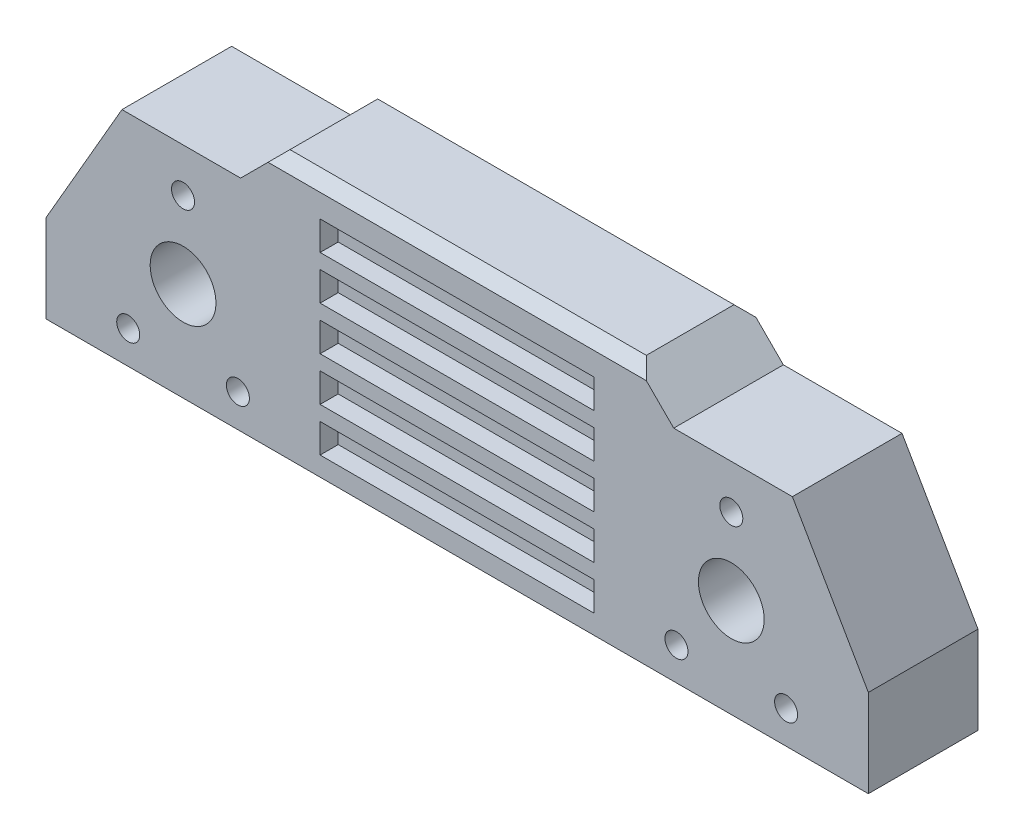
ISO-10303-21;
HEADER;
FILE_DESCRIPTION(('STEP AP214'),'2;1');
FILE_NAME('part.step','',(''),(''),'','','');
FILE_SCHEMA(('AUTOMOTIVE_DESIGN { 1 0 10303 214 1 1 1 1 }'));
ENDSEC;
DATA;
#1=APPLICATION_CONTEXT('core data for automotive mechanical design processes');
#2=APPLICATION_PROTOCOL_DEFINITION('international standard','automotive_design',2000,#1);
#3=PRODUCT_CONTEXT('',#1,'mechanical');
#4=PRODUCT('Part','Part','',(#3));
#5=PRODUCT_RELATED_PRODUCT_CATEGORY('part','',(#4));
#6=PRODUCT_DEFINITION_FORMATION('','',#4);
#7=PRODUCT_DEFINITION_CONTEXT('part definition',#1,'design');
#8=PRODUCT_DEFINITION('design','',#6,#7);
#9=PRODUCT_DEFINITION_SHAPE('','',#8);
#10=(LENGTH_UNIT() NAMED_UNIT(*) SI_UNIT(.MILLI.,.METRE.));
#11=(NAMED_UNIT(*) PLANE_ANGLE_UNIT() SI_UNIT($,.RADIAN.));
#12=(NAMED_UNIT(*) SI_UNIT($,.STERADIAN.) SOLID_ANGLE_UNIT());
#13=UNCERTAINTY_MEASURE_WITH_UNIT(LENGTH_MEASURE(1.E-05),#10,'distance_accuracy_value','');
#14=(GEOMETRIC_REPRESENTATION_CONTEXT(3) GLOBAL_UNCERTAINTY_ASSIGNED_CONTEXT((#13)) GLOBAL_UNIT_ASSIGNED_CONTEXT((#10,
#11,#12)) REPRESENTATION_CONTEXT('',''));
#15=CARTESIAN_POINT('',(0.,0.,0.));
#16=DIRECTION('',(0.,0.,1.));
#17=DIRECTION('',(1.,0.,0.));
#18=AXIS2_PLACEMENT_3D('',#15,#16,#17);
#19=CARTESIAN_POINT('',(0.,0.,10.));
#20=DIRECTION('',(0.,0.,1.));
#21=DIRECTION('',(1.,0.,0.));
#22=AXIS2_PLACEMENT_3D('',#19,#20,#21);
#23=PLANE('',#22);
#24=CARTESIAN_POINT('',(-49.9999999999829,32.,10.));
#25=DIRECTION('',(0.,0.,1.));
#26=DIRECTION('',(1.,0.,0.));
#27=AXIS2_PLACEMENT_3D('',#24,#25,#26);
#28=CIRCLE('',#27,2.09999999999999);
#29=CARTESIAN_POINT('',(-47.899999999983,32.,10.));
#30=VERTEX_POINT('',#29);
#31=EDGE_CURVE('E279',#30,#30,#28,.T.);
#32=ORIENTED_EDGE('',*,*,#31,.F.);
#33=EDGE_LOOP('',(#32));
#34=FACE_BOUND('',#33,.T.);
#35=CARTESIAN_POINT('',(-39.999999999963,6.,10.));
#36=DIRECTION('',(0.,0.,1.));
#37=DIRECTION('',(1.,0.,0.));
#38=AXIS2_PLACEMENT_3D('',#35,#36,#37);
#39=CIRCLE('',#38,2.09999999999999);
#40=CARTESIAN_POINT('',(-37.8999999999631,6.,10.));
#41=VERTEX_POINT('',#40);
#42=EDGE_CURVE('E278',#41,#41,#39,.T.);
#43=ORIENTED_EDGE('',*,*,#42,.F.);
#44=EDGE_LOOP('',(#43));
#45=FACE_BOUND('',#44,.T.);
#46=CARTESIAN_POINT('',(-60.0000000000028,6.,10.));
#47=DIRECTION('',(0.,0.,1.));
#48=DIRECTION('',(1.,0.,0.));
#49=AXIS2_PLACEMENT_3D('',#46,#47,#48);
#50=CIRCLE('',#49,2.09999999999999);
#51=CARTESIAN_POINT('',(-57.9000000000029,6.,10.));
#52=VERTEX_POINT('',#51);
#53=EDGE_CURVE('E289',#52,#52,#50,.T.);
#54=ORIENTED_EDGE('',*,*,#53,.F.);
#55=EDGE_LOOP('',(#54));
#56=FACE_BOUND('',#55,.T.);
#57=CARTESIAN_POINT('',(49.9999999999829,32.,10.));
#58=DIRECTION('',(0.,0.,1.));
#59=DIRECTION('',(1.,0.,0.));
#60=AXIS2_PLACEMENT_3D('',#57,#58,#59);
#61=CIRCLE('',#60,2.09999999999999);
#62=CARTESIAN_POINT('',(52.0999999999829,32.,10.));
#63=VERTEX_POINT('',#62);
#64=EDGE_CURVE('E454',#63,#63,#61,.T.);
#65=ORIENTED_EDGE('',*,*,#64,.F.);
#66=EDGE_LOOP('',(#65));
#67=FACE_BOUND('',#66,.T.);
#68=CARTESIAN_POINT('',(39.999999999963,6.,10.));
#69=DIRECTION('',(0.,0.,1.));
#70=DIRECTION('',(1.,0.,0.));
#71=AXIS2_PLACEMENT_3D('',#68,#69,#70);
#72=CIRCLE('',#71,2.09999999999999);
#73=CARTESIAN_POINT('',(42.099999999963,6.,10.));
#74=VERTEX_POINT('',#73);
#75=EDGE_CURVE('E466',#74,#74,#72,.T.);
#76=ORIENTED_EDGE('',*,*,#75,.F.);
#77=EDGE_LOOP('',(#76));
#78=FACE_BOUND('',#77,.T.);
#79=CARTESIAN_POINT('',(60.0000000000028,6.,10.));
#80=DIRECTION('',(0.,0.,1.));
#81=DIRECTION('',(1.,0.,0.));
#82=AXIS2_PLACEMENT_3D('',#79,#80,#81);
#83=CIRCLE('',#82,2.09999999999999);
#84=CARTESIAN_POINT('',(62.1000000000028,6.,10.));
#85=VERTEX_POINT('',#84);
#86=EDGE_CURVE('E472',#85,#85,#83,.T.);
#87=ORIENTED_EDGE('',*,*,#86,.F.);
#88=EDGE_LOOP('',(#87));
#89=FACE_BOUND('',#88,.T.);
#90=CARTESIAN_POINT('',(-49.9999999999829,18.,10.));
#91=DIRECTION('',(0.,0.,1.));
#92=DIRECTION('',(-1.,0.,0.));
#93=AXIS2_PLACEMENT_3D('',#90,#91,#92);
#94=CIRCLE('',#93,6.);
#95=CARTESIAN_POINT('',(-55.999999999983,18.,10.));
#96=VERTEX_POINT('',#95);
#97=EDGE_CURVE('E485',#96,#96,#94,.T.);
#98=ORIENTED_EDGE('',*,*,#97,.F.);
#99=EDGE_LOOP('',(#98));
#100=FACE_BOUND('',#99,.T.);
#101=DIRECTION('',(-0.707106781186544,0.707106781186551,0.));
#102=VECTOR('',#101,1.);
#103=CARTESIAN_POINT('',(39.4999999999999,40.,10.));
#104=LINE('',#103,#102);
#105=CARTESIAN_POINT('',(39.4999999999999,40.,10.));
#106=VERTEX_POINT('',#105);
#107=CARTESIAN_POINT('',(34.5,45.,10.));
#108=VERTEX_POINT('',#107);
#109=EDGE_CURVE('E499',#106,#108,#104,.T.);
#110=ORIENTED_EDGE('',*,*,#109,.T.);
#111=DIRECTION('',(-1.,0.,0.));
#112=VECTOR('',#111,1.);
#113=CARTESIAN_POINT('',(-32.5,45.,10.));
#114=LINE('',#113,#112);
#115=CARTESIAN_POINT('',(-34.5,45.,10.));
#116=VERTEX_POINT('',#115);
#117=EDGE_CURVE('E11',#108,#116,#114,.T.);
#118=ORIENTED_EDGE('',*,*,#117,.T.);
#119=DIRECTION('',(-0.707106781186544,-0.707106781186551,0.));
#120=VECTOR('',#119,1.);
#121=CARTESIAN_POINT('',(-39.4999999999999,40.,10.));
#122=LINE('',#121,#120);
#123=CARTESIAN_POINT('',(-39.4999999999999,40.,10.));
#124=VERTEX_POINT('',#123);
#125=EDGE_CURVE('E501',#116,#124,#122,.T.);
#126=ORIENTED_EDGE('',*,*,#125,.T.);
#127=DIRECTION('',(-1.,0.,0.));
#128=VECTOR('',#127,1.);
#129=CARTESIAN_POINT('',(-61.1435935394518,40.,10.));
#130=LINE('',#129,#128);
#131=CARTESIAN_POINT('',(-61.1435935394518,40.,10.));
#132=VERTEX_POINT('',#131);
#133=EDGE_CURVE('E503',#124,#132,#130,.T.);
#134=ORIENTED_EDGE('',*,*,#133,.T.);
#135=DIRECTION('',(-0.500000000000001,-0.866025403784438,0.));
#136=VECTOR('',#135,1.);
#137=CARTESIAN_POINT('',(-75.0000000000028,16.,10.));
#138=LINE('',#137,#136);
#139=CARTESIAN_POINT('',(-75.0000000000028,16.,10.));
#140=VERTEX_POINT('',#139);
#141=EDGE_CURVE('E505',#132,#140,#138,.T.);
#142=ORIENTED_EDGE('',*,*,#141,.T.);
#143=DIRECTION('',(0.,-1.,0.));
#144=VECTOR('',#143,1.);
#145=CARTESIAN_POINT('',(-75.0000000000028,0.,10.));
#146=LINE('',#145,#144);
#147=CARTESIAN_POINT('',(-75.0000000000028,0.,10.));
#148=VERTEX_POINT('',#147);
#149=EDGE_CURVE('E507',#140,#148,#146,.T.);
#150=ORIENTED_EDGE('',*,*,#149,.T.);
#151=DIRECTION('',(1.,0.,0.));
#152=VECTOR('',#151,1.);
#153=CARTESIAN_POINT('',(-75.0000000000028,0.,10.));
#154=LINE('',#153,#152);
#155=CARTESIAN_POINT('',(75.0000000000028,0.,10.));
#156=VERTEX_POINT('',#155);
#157=EDGE_CURVE('E509',#148,#156,#154,.T.);
#158=ORIENTED_EDGE('',*,*,#157,.T.);
#159=DIRECTION('',(0.,1.,0.));
#160=VECTOR('',#159,1.);
#161=CARTESIAN_POINT('',(75.0000000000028,0.,10.));
#162=LINE('',#161,#160);
#163=CARTESIAN_POINT('',(75.0000000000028,16.,10.));
#164=VERTEX_POINT('',#163);
#165=EDGE_CURVE('E491',#156,#164,#162,.T.);
#166=ORIENTED_EDGE('',*,*,#165,.T.);
#167=DIRECTION('',(-0.500000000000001,0.866025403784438,0.));
#168=VECTOR('',#167,1.);
#169=CARTESIAN_POINT('',(75.0000000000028,16.,10.));
#170=LINE('',#169,#168);
#171=CARTESIAN_POINT('',(61.1435935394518,40.,10.));
#172=VERTEX_POINT('',#171);
#173=EDGE_CURVE('E494',#164,#172,#170,.T.);
#174=ORIENTED_EDGE('',*,*,#173,.T.);
#175=DIRECTION('',(-1.,0.,0.));
#176=VECTOR('',#175,1.);
#177=CARTESIAN_POINT('',(61.1435935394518,40.,10.));
#178=LINE('',#177,#176);
#179=EDGE_CURVE('E497',#172,#106,#178,.T.);
#180=ORIENTED_EDGE('',*,*,#179,.T.);
#181=EDGE_LOOP('',(#110,#118,#126,#134,#142,#150,#158,#166,#174,#180));
#182=FACE_BOUND('',#181,.T.);
#183=CARTESIAN_POINT('',(49.9999999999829,18.,10.));
#184=DIRECTION('',(0.,0.,1.));
#185=DIRECTION('',(1.,0.,0.));
#186=AXIS2_PLACEMENT_3D('',#183,#184,#185);
#187=CIRCLE('',#186,6.);
#188=CARTESIAN_POINT('',(55.999999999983,18.,10.));
#189=VERTEX_POINT('',#188);
#190=EDGE_CURVE('E479',#189,#189,#187,.T.);
#191=ORIENTED_EDGE('',*,*,#190,.F.);
#192=EDGE_LOOP('',(#191));
#193=FACE_BOUND('',#192,.T.);
#194=DIRECTION('',(1.,0.,0.));
#195=VECTOR('',#194,1.);
#196=CARTESIAN_POINT('',(-25.,3.5,10.));
#197=LINE('',#196,#195);
#198=CARTESIAN_POINT('',(-25.,3.5,10.));
#199=VERTEX_POINT('',#198);
#200=CARTESIAN_POINT('',(25.,3.5,10.));
#201=VERTEX_POINT('',#200);
#202=EDGE_CURVE('E451',#199,#201,#197,.T.);
#203=ORIENTED_EDGE('',*,*,#202,.F.);
#204=DIRECTION('',(0.,-1.,0.));
#205=VECTOR('',#204,1.);
#206=CARTESIAN_POINT('',(-25.,8.8,10.));
#207=LINE('',#206,#205);
#208=CARTESIAN_POINT('',(-25.,8.8,10.));
#209=VERTEX_POINT('',#208);
#210=EDGE_CURVE('E438',#209,#199,#207,.T.);
#211=ORIENTED_EDGE('',*,*,#210,.F.);
#212=DIRECTION('',(1.,0.,0.));
#213=VECTOR('',#212,1.);
#214=CARTESIAN_POINT('',(-25.,8.8,10.));
#215=LINE('',#214,#213);
#216=CARTESIAN_POINT('',(25.,8.8,10.));
#217=VERTEX_POINT('',#216);
#218=EDGE_CURVE('E455',#209,#217,#215,.T.);
#219=ORIENTED_EDGE('',*,*,#218,.T.);
#220=DIRECTION('',(0.,-1.,0.));
#221=VECTOR('',#220,1.);
#222=CARTESIAN_POINT('',(25.,8.8,10.));
#223=LINE('',#222,#221);
#224=EDGE_CURVE('E432',#217,#201,#223,.T.);
#225=ORIENTED_EDGE('',*,*,#224,.T.);
#226=EDGE_LOOP('',(#203,#211,#219,#225));
#227=FACE_BOUND('',#226,.T.);
#228=DIRECTION('',(1.,0.,0.));
#229=VECTOR('',#228,1.);
#230=CARTESIAN_POINT('',(-25.,11.5,10.));
#231=LINE('',#230,#229);
#232=CARTESIAN_POINT('',(-25.,11.5,10.));
#233=VERTEX_POINT('',#232);
#234=CARTESIAN_POINT('',(25.,11.5,10.));
#235=VERTEX_POINT('',#234);
#236=EDGE_CURVE('E418',#233,#235,#231,.T.);
#237=ORIENTED_EDGE('',*,*,#236,.F.);
#238=DIRECTION('',(0.,-1.,0.));
#239=VECTOR('',#238,1.);
#240=CARTESIAN_POINT('',(-25.,16.8,10.));
#241=LINE('',#240,#239);
#242=CARTESIAN_POINT('',(-25.,16.8,10.));
#243=VERTEX_POINT('',#242);
#244=EDGE_CURVE('E405',#243,#233,#241,.T.);
#245=ORIENTED_EDGE('',*,*,#244,.F.);
#246=DIRECTION('',(1.,0.,0.));
#247=VECTOR('',#246,1.);
#248=CARTESIAN_POINT('',(-25.,16.8,10.));
#249=LINE('',#248,#247);
#250=CARTESIAN_POINT('',(25.,16.8,10.));
#251=VERTEX_POINT('',#250);
#252=EDGE_CURVE('E422',#243,#251,#249,.T.);
#253=ORIENTED_EDGE('',*,*,#252,.T.);
#254=DIRECTION('',(0.,-1.,0.));
#255=VECTOR('',#254,1.);
#256=CARTESIAN_POINT('',(25.,16.8,10.));
#257=LINE('',#256,#255);
#258=EDGE_CURVE('E399',#251,#235,#257,.T.);
#259=ORIENTED_EDGE('',*,*,#258,.T.);
#260=EDGE_LOOP('',(#237,#245,#253,#259));
#261=FACE_BOUND('',#260,.T.);
#262=DIRECTION('',(1.,0.,0.));
#263=VECTOR('',#262,1.);
#264=CARTESIAN_POINT('',(-25.,35.5,10.));
#265=LINE('',#264,#263);
#266=CARTESIAN_POINT('',(-25.,35.5,10.));
#267=VERTEX_POINT('',#266);
#268=CARTESIAN_POINT('',(25.,35.5,10.));
#269=VERTEX_POINT('',#268);
#270=EDGE_CURVE('E349',#267,#269,#265,.T.);
#271=ORIENTED_EDGE('',*,*,#270,.F.);
#272=DIRECTION('',(0.,-1.,0.));
#273=VECTOR('',#272,1.);
#274=CARTESIAN_POINT('',(-25.,40.8,10.));
#275=LINE('',#274,#273);
#276=CARTESIAN_POINT('',(-25.,40.8,10.));
#277=VERTEX_POINT('',#276);
#278=EDGE_CURVE('E374',#277,#267,#275,.T.);
#279=ORIENTED_EDGE('',*,*,#278,.F.);
#280=DIRECTION('',(1.,0.,0.));
#281=VECTOR('',#280,1.);
#282=CARTESIAN_POINT('',(-25.,40.8,10.));
#283=LINE('',#282,#281);
#284=CARTESIAN_POINT('',(25.,40.8,10.));
#285=VERTEX_POINT('',#284);
#286=EDGE_CURVE('E389',#277,#285,#283,.T.);
#287=ORIENTED_EDGE('',*,*,#286,.T.);
#288=DIRECTION('',(0.,-1.,0.));
#289=VECTOR('',#288,1.);
#290=CARTESIAN_POINT('',(25.,40.8,10.));
#291=LINE('',#290,#289);
#292=EDGE_CURVE('E368',#285,#269,#291,.T.);
#293=ORIENTED_EDGE('',*,*,#292,.T.);
#294=EDGE_LOOP('',(#271,#279,#287,#293));
#295=FACE_BOUND('',#294,.T.);
#296=DIRECTION('',(1.,0.,0.));
#297=VECTOR('',#296,1.);
#298=CARTESIAN_POINT('',(-25.,27.5,10.));
#299=LINE('',#298,#297);
#300=CARTESIAN_POINT('',(-25.,27.5,10.));
#301=VERTEX_POINT('',#300);
#302=CARTESIAN_POINT('',(25.,27.5,10.));
#303=VERTEX_POINT('',#302);
#304=EDGE_CURVE('E314',#301,#303,#299,.T.);
#305=ORIENTED_EDGE('',*,*,#304,.F.);
#306=DIRECTION('',(0.,-1.,0.));
#307=VECTOR('',#306,1.);
#308=CARTESIAN_POINT('',(-25.,32.8,10.));
#309=LINE('',#308,#307);
#310=CARTESIAN_POINT('',(-25.,32.8,10.));
#311=VERTEX_POINT('',#310);
#312=EDGE_CURVE('E341',#311,#301,#309,.T.);
#313=ORIENTED_EDGE('',*,*,#312,.F.);
#314=DIRECTION('',(1.,0.,0.));
#315=VECTOR('',#314,1.);
#316=CARTESIAN_POINT('',(-25.,32.8,10.));
#317=LINE('',#316,#315);
#318=CARTESIAN_POINT('',(25.,32.8,10.));
#319=VERTEX_POINT('',#318);
#320=EDGE_CURVE('E358',#311,#319,#317,.T.);
#321=ORIENTED_EDGE('',*,*,#320,.T.);
#322=DIRECTION('',(0.,-1.,0.));
#323=VECTOR('',#322,1.);
#324=CARTESIAN_POINT('',(25.,32.8,10.));
#325=LINE('',#324,#323);
#326=EDGE_CURVE('E335',#319,#303,#325,.T.);
#327=ORIENTED_EDGE('',*,*,#326,.T.);
#328=EDGE_LOOP('',(#305,#313,#321,#327));
#329=FACE_BOUND('',#328,.T.);
#330=DIRECTION('',(1.,0.,0.));
#331=VECTOR('',#330,1.);
#332=CARTESIAN_POINT('',(-25.,19.5,10.));
#333=LINE('',#332,#331);
#334=CARTESIAN_POINT('',(-25.,19.5,10.));
#335=VERTEX_POINT('',#334);
#336=CARTESIAN_POINT('',(25.,19.5,10.));
#337=VERTEX_POINT('',#336);
#338=EDGE_CURVE('E321',#335,#337,#333,.T.);
#339=ORIENTED_EDGE('',*,*,#338,.F.);
#340=DIRECTION('',(0.,-1.,0.));
#341=VECTOR('',#340,1.);
#342=CARTESIAN_POINT('',(-25.,24.8,10.));
#343=LINE('',#342,#341);
#344=CARTESIAN_POINT('',(-25.,24.8,10.));
#345=VERTEX_POINT('',#344);
#346=EDGE_CURVE('E306',#345,#335,#343,.T.);
#347=ORIENTED_EDGE('',*,*,#346,.F.);
#348=DIRECTION('',(1.,0.,0.));
#349=VECTOR('',#348,1.);
#350=CARTESIAN_POINT('',(-25.,24.8,10.));
#351=LINE('',#350,#349);
#352=CARTESIAN_POINT('',(25.,24.8,10.));
#353=VERTEX_POINT('',#352);
#354=EDGE_CURVE('E325',#345,#353,#351,.T.);
#355=ORIENTED_EDGE('',*,*,#354,.T.);
#356=DIRECTION('',(0.,-1.,0.));
#357=VECTOR('',#356,1.);
#358=CARTESIAN_POINT('',(25.,24.8,10.));
#359=LINE('',#358,#357);
#360=EDGE_CURVE('E300',#353,#337,#359,.T.);
#361=ORIENTED_EDGE('',*,*,#360,.T.);
#362=EDGE_LOOP('',(#339,#347,#355,#361));
#363=FACE_BOUND('',#362,.T.);
#364=ADVANCED_FACE('F39',(#34,#45,#56,#67,#78,#89,#100,#182,#193,#227,#261,#295,#329,#363),#23,.T.);
#365=CARTESIAN_POINT('',(0.,0.,-10.));
#366=DIRECTION('',(0.,0.,1.));
#367=DIRECTION('',(1.,0.,0.));
#368=AXIS2_PLACEMENT_3D('',#365,#366,#367);
#369=PLANE('',#368);
#370=DIRECTION('',(-0.707106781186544,-0.707106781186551,0.));
#371=VECTOR('',#370,1.);
#372=CARTESIAN_POINT('',(-39.4999999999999,40.,-10.));
#373=LINE('',#372,#371);
#374=CARTESIAN_POINT('',(-34.5,45.,-10.));
#375=VERTEX_POINT('',#374);
#376=CARTESIAN_POINT('',(-39.4999999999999,40.,-10.));
#377=VERTEX_POINT('',#376);
#378=EDGE_CURVE('E520',#375,#377,#373,.T.);
#379=ORIENTED_EDGE('',*,*,#378,.F.);
#380=DIRECTION('',(1.,0.,0.));
#381=VECTOR('',#380,1.);
#382=CARTESIAN_POINT('',(0.,45.,-10.));
#383=LINE('',#382,#381);
#384=CARTESIAN_POINT('',(34.5,45.,-10.));
#385=VERTEX_POINT('',#384);
#386=EDGE_CURVE('E62',#375,#385,#383,.T.);
#387=ORIENTED_EDGE('',*,*,#386,.T.);
#388=DIRECTION('',(-0.707106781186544,0.707106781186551,0.));
#389=VECTOR('',#388,1.);
#390=CARTESIAN_POINT('',(39.4999999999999,40.,-10.));
#391=LINE('',#390,#389);
#392=CARTESIAN_POINT('',(39.4999999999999,40.,-10.));
#393=VERTEX_POINT('',#392);
#394=EDGE_CURVE('E518',#393,#385,#391,.T.);
#395=ORIENTED_EDGE('',*,*,#394,.F.);
#396=DIRECTION('',(-1.,0.,0.));
#397=VECTOR('',#396,1.);
#398=CARTESIAN_POINT('',(61.1435935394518,40.,-10.));
#399=LINE('',#398,#397);
#400=CARTESIAN_POINT('',(61.1435935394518,40.,-10.));
#401=VERTEX_POINT('',#400);
#402=EDGE_CURVE('E516',#401,#393,#399,.T.);
#403=ORIENTED_EDGE('',*,*,#402,.F.);
#404=DIRECTION('',(-0.500000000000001,0.866025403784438,0.));
#405=VECTOR('',#404,1.);
#406=CARTESIAN_POINT('',(75.0000000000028,16.,-10.));
#407=LINE('',#406,#405);
#408=CARTESIAN_POINT('',(75.0000000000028,16.,-10.));
#409=VERTEX_POINT('',#408);
#410=EDGE_CURVE('E514',#409,#401,#407,.T.);
#411=ORIENTED_EDGE('',*,*,#410,.F.);
#412=DIRECTION('',(0.,1.,0.));
#413=VECTOR('',#412,1.);
#414=CARTESIAN_POINT('',(75.0000000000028,0.,-10.));
#415=LINE('',#414,#413);
#416=CARTESIAN_POINT('',(75.0000000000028,0.,-10.));
#417=VERTEX_POINT('',#416);
#418=EDGE_CURVE('E488',#417,#409,#415,.T.);
#419=ORIENTED_EDGE('',*,*,#418,.F.);
#420=DIRECTION('',(1.,0.,0.));
#421=VECTOR('',#420,1.);
#422=CARTESIAN_POINT('',(-75.0000000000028,0.,-10.));
#423=LINE('',#422,#421);
#424=CARTESIAN_POINT('',(-75.0000000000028,0.,-10.));
#425=VERTEX_POINT('',#424);
#426=EDGE_CURVE('E495',#425,#417,#423,.T.);
#427=ORIENTED_EDGE('',*,*,#426,.F.);
#428=DIRECTION('',(0.,-1.,0.));
#429=VECTOR('',#428,1.);
#430=CARTESIAN_POINT('',(-75.0000000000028,0.,-10.));
#431=LINE('',#430,#429);
#432=CARTESIAN_POINT('',(-75.0000000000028,16.,-10.));
#433=VERTEX_POINT('',#432);
#434=EDGE_CURVE('E526',#433,#425,#431,.T.);
#435=ORIENTED_EDGE('',*,*,#434,.F.);
#436=DIRECTION('',(-0.500000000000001,-0.866025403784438,0.));
#437=VECTOR('',#436,1.);
#438=CARTESIAN_POINT('',(-75.0000000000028,16.,-10.));
#439=LINE('',#438,#437);
#440=CARTESIAN_POINT('',(-61.1435935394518,40.,-10.));
#441=VERTEX_POINT('',#440);
#442=EDGE_CURVE('E524',#441,#433,#439,.T.);
#443=ORIENTED_EDGE('',*,*,#442,.F.);
#444=DIRECTION('',(-1.,0.,0.));
#445=VECTOR('',#444,1.);
#446=CARTESIAN_POINT('',(-61.1435935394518,40.,-10.));
#447=LINE('',#446,#445);
#448=EDGE_CURVE('E522',#377,#441,#447,.T.);
#449=ORIENTED_EDGE('',*,*,#448,.F.);
#450=EDGE_LOOP('',(#379,#387,#395,#403,#411,#419,#427,#435,#443,#449));
#451=FACE_BOUND('',#450,.T.);
#452=CARTESIAN_POINT('',(-49.9999999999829,18.,-10.));
#453=DIRECTION('',(0.,0.,1.));
#454=DIRECTION('',(-1.,0.,0.));
#455=AXIS2_PLACEMENT_3D('',#452,#453,#454);
#456=CIRCLE('',#455,6.);
#457=CARTESIAN_POINT('',(-55.999999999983,18.,-10.));
#458=VERTEX_POINT('',#457);
#459=EDGE_CURVE('E482',#458,#458,#456,.T.);
#460=ORIENTED_EDGE('',*,*,#459,.T.);
#461=EDGE_LOOP('',(#460));
#462=FACE_BOUND('',#461,.T.);
#463=CARTESIAN_POINT('',(49.9999999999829,18.,-10.));
#464=DIRECTION('',(0.,0.,1.));
#465=DIRECTION('',(1.,0.,0.));
#466=AXIS2_PLACEMENT_3D('',#463,#464,#465);
#467=CIRCLE('',#466,6.);
#468=CARTESIAN_POINT('',(55.999999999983,18.,-10.));
#469=VERTEX_POINT('',#468);
#470=EDGE_CURVE('E478',#469,#469,#467,.T.);
#471=ORIENTED_EDGE('',*,*,#470,.T.);
#472=EDGE_LOOP('',(#471));
#473=FACE_BOUND('',#472,.T.);
#474=ADVANCED_FACE('F581',(#451,#462,#473),#369,.F.);
#475=CARTESIAN_POINT('',(75.0000000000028,0.,10.));
#476=DIRECTION('',(-1.,0.,0.));
#477=DIRECTION('',(0.,0.,1.));
#478=AXIS2_PLACEMENT_3D('',#475,#476,#477);
#479=PLANE('',#478);
#480=ORIENTED_EDGE('',*,*,#418,.T.);
#481=DIRECTION('',(0.,0.,-1.));
#482=VECTOR('',#481,1.);
#483=CARTESIAN_POINT('',(75.0000000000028,16.,10.));
#484=LINE('',#483,#482);
#485=EDGE_CURVE('E555',#164,#409,#484,.T.);
#486=ORIENTED_EDGE('',*,*,#485,.F.);
#487=ORIENTED_EDGE('',*,*,#165,.F.);
#488=DIRECTION('',(0.,0.,-1.));
#489=VECTOR('',#488,1.);
#490=CARTESIAN_POINT('',(75.0000000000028,0.,10.));
#491=LINE('',#490,#489);
#492=EDGE_CURVE('E511',#156,#417,#491,.T.);
#493=ORIENTED_EDGE('',*,*,#492,.T.);
#494=EDGE_LOOP('',(#480,#486,#487,#493));
#495=FACE_BOUND('',#494,.T.);
#496=ADVANCED_FACE('F616',(#495),#479,.F.);
#497=CARTESIAN_POINT('',(75.0000000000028,16.,10.));
#498=DIRECTION('',(-0.866025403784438,-0.500000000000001,0.));
#499=DIRECTION('',(0.500000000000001,-0.866025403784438,0.));
#500=AXIS2_PLACEMENT_3D('',#497,#498,#499);
#501=PLANE('',#500);
#502=ORIENTED_EDGE('',*,*,#410,.T.);
#503=DIRECTION('',(0.,0.,-1.));
#504=VECTOR('',#503,1.);
#505=CARTESIAN_POINT('',(61.1435935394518,40.,10.));
#506=LINE('',#505,#504);
#507=EDGE_CURVE('E552',#172,#401,#506,.T.);
#508=ORIENTED_EDGE('',*,*,#507,.F.);
#509=ORIENTED_EDGE('',*,*,#173,.F.);
#510=ORIENTED_EDGE('',*,*,#485,.T.);
#511=EDGE_LOOP('',(#502,#508,#509,#510));
#512=FACE_BOUND('',#511,.T.);
#513=ADVANCED_FACE('F645',(#512),#501,.F.);
#514=CARTESIAN_POINT('',(61.1435935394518,40.,10.));
#515=DIRECTION('',(0.,-1.,0.));
#516=DIRECTION('',(1.,0.,0.));
#517=AXIS2_PLACEMENT_3D('',#514,#515,#516);
#518=PLANE('',#517);
#519=ORIENTED_EDGE('',*,*,#402,.T.);
#520=DIRECTION('',(0.,0.,-1.));
#521=VECTOR('',#520,1.);
#522=CARTESIAN_POINT('',(39.4999999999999,40.,10.));
#523=LINE('',#522,#521);
#524=EDGE_CURVE('E549',#106,#393,#523,.T.);
#525=ORIENTED_EDGE('',*,*,#524,.F.);
#526=ORIENTED_EDGE('',*,*,#179,.F.);
#527=ORIENTED_EDGE('',*,*,#507,.T.);
#528=EDGE_LOOP('',(#519,#525,#526,#527));
#529=FACE_BOUND('',#528,.T.);
#530=ADVANCED_FACE('F642',(#529),#518,.F.);
#531=CARTESIAN_POINT('',(39.4999999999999,40.,10.));
#532=DIRECTION('',(-0.707106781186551,-0.707106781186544,0.));
#533=DIRECTION('',(0.707106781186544,-0.707106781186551,0.));
#534=AXIS2_PLACEMENT_3D('',#531,#532,#533);
#535=PLANE('',#534);
#536=ORIENTED_EDGE('',*,*,#394,.T.);
#537=DIRECTION('',(0.577350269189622,-0.577350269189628,-0.577350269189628));
#538=VECTOR('',#537,1.);
#539=CARTESIAN_POINT('',(32.5,47.,-8.00000000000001));
#540=LINE('',#539,#538);
#541=CARTESIAN_POINT('',(32.5,47.,-8.00000000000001));
#542=VERTEX_POINT('',#541);
#543=EDGE_CURVE('E47',#385,#542,#540,.F.);
#544=ORIENTED_EDGE('',*,*,#543,.T.);
#545=DIRECTION('',(0.,0.,-1.));
#546=VECTOR('',#545,1.);
#547=CARTESIAN_POINT('',(32.5,47.,10.));
#548=LINE('',#547,#546);
#549=CARTESIAN_POINT('',(32.5,47.,7.99999999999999));
#550=VERTEX_POINT('',#549);
#551=EDGE_CURVE('E546',#550,#542,#548,.T.);
#552=ORIENTED_EDGE('',*,*,#551,.F.);
#553=DIRECTION('',(0.577350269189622,-0.577350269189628,0.577350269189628));
#554=VECTOR('',#553,1.);
#555=CARTESIAN_POINT('',(23.0000000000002,56.4999999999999,-1.49999999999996));
#556=LINE('',#555,#554);
#557=EDGE_CURVE('E54',#550,#108,#556,.T.);
#558=ORIENTED_EDGE('',*,*,#557,.T.);
#559=ORIENTED_EDGE('',*,*,#109,.F.);
#560=ORIENTED_EDGE('',*,*,#524,.T.);
#561=EDGE_LOOP('',(#536,#544,#552,#558,#559,#560));
#562=FACE_BOUND('',#561,.T.);
#563=ADVANCED_FACE('F569',(#562),#535,.F.);
#564=CARTESIAN_POINT('',(32.5,47.,10.));
#565=DIRECTION('',(0.,-1.,0.));
#566=DIRECTION('',(0.,0.,-1.));
#567=AXIS2_PLACEMENT_3D('',#564,#565,#566);
#568=PLANE('',#567);
#569=ORIENTED_EDGE('',*,*,#551,.T.);
#570=DIRECTION('',(-1.,0.,0.));
#571=VECTOR('',#570,1.);
#572=CARTESIAN_POINT('',(32.5,47.,-8.00000000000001));
#573=LINE('',#572,#571);
#574=CARTESIAN_POINT('',(-32.5,47.,-8.00000000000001));
#575=VERTEX_POINT('',#574);
#576=EDGE_CURVE('E560',#542,#575,#573,.T.);
#577=ORIENTED_EDGE('',*,*,#576,.T.);
#578=DIRECTION('',(0.,0.,-1.));
#579=VECTOR('',#578,1.);
#580=CARTESIAN_POINT('',(-32.5,47.,10.));
#581=LINE('',#580,#579);
#582=CARTESIAN_POINT('',(-32.5,47.,7.99999999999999));
#583=VERTEX_POINT('',#582);
#584=EDGE_CURVE('E543',#583,#575,#581,.T.);
#585=ORIENTED_EDGE('',*,*,#584,.F.);
#586=DIRECTION('',(1.,0.,0.));
#587=VECTOR('',#586,1.);
#588=CARTESIAN_POINT('',(32.5,47.,7.99999999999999));
#589=LINE('',#588,#587);
#590=EDGE_CURVE('E558',#583,#550,#589,.T.);
#591=ORIENTED_EDGE('',*,*,#590,.T.);
#592=EDGE_LOOP('',(#569,#577,#585,#591));
#593=FACE_BOUND('',#592,.T.);
#594=ADVANCED_FACE('F573',(#593),#568,.F.);
#595=CARTESIAN_POINT('',(-39.4999999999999,40.,10.));
#596=DIRECTION('',(0.707106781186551,-0.707106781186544,0.));
#597=DIRECTION('',(0.707106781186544,0.707106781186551,0.));
#598=AXIS2_PLACEMENT_3D('',#595,#596,#597);
#599=PLANE('',#598);
#600=ORIENTED_EDGE('',*,*,#584,.T.);
#601=DIRECTION('',(0.577350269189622,0.577350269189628,0.577350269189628));
#602=VECTOR('',#601,1.);
#603=CARTESIAN_POINT('',(-10.8333333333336,68.6666666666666,13.6666666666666));
#604=LINE('',#603,#602);
#605=EDGE_CURVE('E565',#575,#375,#604,.F.);
#606=ORIENTED_EDGE('',*,*,#605,.T.);
#607=ORIENTED_EDGE('',*,*,#378,.T.);
#608=DIRECTION('',(0.,0.,-1.));
#609=VECTOR('',#608,1.);
#610=CARTESIAN_POINT('',(-39.4999999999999,40.,10.));
#611=LINE('',#610,#609);
#612=EDGE_CURVE('E540',#124,#377,#611,.T.);
#613=ORIENTED_EDGE('',*,*,#612,.F.);
#614=ORIENTED_EDGE('',*,*,#125,.F.);
#615=DIRECTION('',(0.577350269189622,0.577350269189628,-0.577350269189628));
#616=VECTOR('',#615,1.);
#617=CARTESIAN_POINT('',(-23.0000000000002,56.4999999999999,-1.49999999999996));
#618=LINE('',#617,#616);
#619=EDGE_CURVE('E563',#116,#583,#618,.T.);
#620=ORIENTED_EDGE('',*,*,#619,.T.);
#621=EDGE_LOOP('',(#600,#606,#607,#613,#614,#620));
#622=FACE_BOUND('',#621,.T.);
#623=ADVANCED_FACE('F578',(#622),#599,.F.);
#624=CARTESIAN_POINT('',(-61.1435935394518,40.,10.));
#625=DIRECTION('',(0.,-1.,0.));
#626=DIRECTION('',(1.,0.,0.));
#627=AXIS2_PLACEMENT_3D('',#624,#625,#626);
#628=PLANE('',#627);
#629=ORIENTED_EDGE('',*,*,#448,.T.);
#630=DIRECTION('',(0.,0.,-1.));
#631=VECTOR('',#630,1.);
#632=CARTESIAN_POINT('',(-61.1435935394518,40.,10.));
#633=LINE('',#632,#631);
#634=EDGE_CURVE('E537',#132,#441,#633,.T.);
#635=ORIENTED_EDGE('',*,*,#634,.F.);
#636=ORIENTED_EDGE('',*,*,#133,.F.);
#637=ORIENTED_EDGE('',*,*,#612,.T.);
#638=EDGE_LOOP('',(#629,#635,#636,#637));
#639=FACE_BOUND('',#638,.T.);
#640=ADVANCED_FACE('F587',(#639),#628,.F.);
#641=CARTESIAN_POINT('',(-75.0000000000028,16.,10.));
#642=DIRECTION('',(0.866025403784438,-0.500000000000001,0.));
#643=DIRECTION('',(0.500000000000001,0.866025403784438,0.));
#644=AXIS2_PLACEMENT_3D('',#641,#642,#643);
#645=PLANE('',#644);
#646=ORIENTED_EDGE('',*,*,#442,.T.);
#647=DIRECTION('',(0.,0.,-1.));
#648=VECTOR('',#647,1.);
#649=CARTESIAN_POINT('',(-75.0000000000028,16.,10.));
#650=LINE('',#649,#648);
#651=EDGE_CURVE('E534',#140,#433,#650,.T.);
#652=ORIENTED_EDGE('',*,*,#651,.F.);
#653=ORIENTED_EDGE('',*,*,#141,.F.);
#654=ORIENTED_EDGE('',*,*,#634,.T.);
#655=EDGE_LOOP('',(#646,#652,#653,#654));
#656=FACE_BOUND('',#655,.T.);
#657=ADVANCED_FACE('F591',(#656),#645,.F.);
#658=CARTESIAN_POINT('',(-75.0000000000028,0.,10.));
#659=DIRECTION('',(1.,0.,0.));
#660=DIRECTION('',(0.,0.,-1.));
#661=AXIS2_PLACEMENT_3D('',#658,#659,#660);
#662=PLANE('',#661);
#663=ORIENTED_EDGE('',*,*,#434,.T.);
#664=DIRECTION('',(0.,0.,-1.));
#665=VECTOR('',#664,1.);
#666=CARTESIAN_POINT('',(-75.0000000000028,0.,10.));
#667=LINE('',#666,#665);
#668=EDGE_CURVE('E531',#148,#425,#667,.T.);
#669=ORIENTED_EDGE('',*,*,#668,.F.);
#670=ORIENTED_EDGE('',*,*,#149,.F.);
#671=ORIENTED_EDGE('',*,*,#651,.T.);
#672=EDGE_LOOP('',(#663,#669,#670,#671));
#673=FACE_BOUND('',#672,.T.);
#674=ADVANCED_FACE('F627',(#673),#662,.F.);
#675=CARTESIAN_POINT('',(-75.0000000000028,0.,10.));
#676=DIRECTION('',(0.,1.,0.));
#677=DIRECTION('',(0.,0.,1.));
#678=AXIS2_PLACEMENT_3D('',#675,#676,#677);
#679=PLANE('',#678);
#680=ORIENTED_EDGE('',*,*,#426,.T.);
#681=ORIENTED_EDGE('',*,*,#492,.F.);
#682=ORIENTED_EDGE('',*,*,#157,.F.);
#683=ORIENTED_EDGE('',*,*,#668,.T.);
#684=EDGE_LOOP('',(#680,#681,#682,#683));
#685=FACE_BOUND('',#684,.T.);
#686=ADVANCED_FACE('F624',(#685),#679,.F.);
#687=CARTESIAN_POINT('',(-49.9999999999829,18.,10.));
#688=DIRECTION('',(0.,0.,-1.));
#689=DIRECTION('',(-1.,0.,0.));
#690=AXIS2_PLACEMENT_3D('',#687,#688,#689);
#691=CYLINDRICAL_SURFACE('',#690,6.);
#692=ORIENTED_EDGE('',*,*,#97,.T.);
#693=EDGE_LOOP('',(#692));
#694=FACE_BOUND('',#693,.T.);
#695=ORIENTED_EDGE('',*,*,#459,.F.);
#696=EDGE_LOOP('',(#695));
#697=FACE_BOUND('',#696,.T.);
#698=ADVANCED_FACE('F621',(#694,#697),#691,.F.);
#699=CARTESIAN_POINT('',(49.9999999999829,18.,10.));
#700=DIRECTION('',(0.,0.,-1.));
#701=DIRECTION('',(-1.,0.,0.));
#702=AXIS2_PLACEMENT_3D('',#699,#700,#701);
#703=CYLINDRICAL_SURFACE('',#702,6.);
#704=ORIENTED_EDGE('',*,*,#190,.T.);
#705=EDGE_LOOP('',(#704));
#706=FACE_BOUND('',#705,.T.);
#707=ORIENTED_EDGE('',*,*,#470,.F.);
#708=EDGE_LOOP('',(#707));
#709=FACE_BOUND('',#708,.T.);
#710=ADVANCED_FACE('F708',(#706,#709),#703,.F.);
#711=CARTESIAN_POINT('',(60.0000000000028,6.,-4.));
#712=DIRECTION('',(0.,0.,1.));
#713=DIRECTION('',(1.,0.,0.));
#714=AXIS2_PLACEMENT_3D('',#711,#712,#713);
#715=CONICAL_SURFACE('',#714,2.09999999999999,1.02974425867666);
#716=CARTESIAN_POINT('',(60.0000000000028,6.,-5.26180729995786));
#717=VERTEX_POINT('',#716);
#718=VERTEX_LOOP('',#717);
#719=FACE_BOUND('',#718,.T.);
#720=CARTESIAN_POINT('',(60.0000000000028,6.,-4.));
#721=DIRECTION('',(0.,0.,1.));
#722=DIRECTION('',(1.,0.,0.));
#723=AXIS2_PLACEMENT_3D('',#720,#721,#722);
#724=CIRCLE('',#723,2.09999999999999);
#725=CARTESIAN_POINT('',(62.1000000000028,6.,-4.));
#726=VERTEX_POINT('',#725);
#727=EDGE_CURVE('E475',#726,#726,#724,.T.);
#728=ORIENTED_EDGE('',*,*,#727,.T.);
#729=EDGE_LOOP('',(#728));
#730=FACE_BOUND('',#729,.T.);
#731=ADVANCED_FACE('F715',(#719,#730),#715,.F.);
#732=CARTESIAN_POINT('',(60.0000000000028,6.,10.));
#733=DIRECTION('',(0.,0.,1.));
#734=DIRECTION('',(1.,0.,0.));
#735=AXIS2_PLACEMENT_3D('',#732,#733,#734);
#736=CYLINDRICAL_SURFACE('',#735,2.09999999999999);
#737=ORIENTED_EDGE('',*,*,#727,.F.);
#738=EDGE_LOOP('',(#737));
#739=FACE_BOUND('',#738,.T.);
#740=ORIENTED_EDGE('',*,*,#86,.T.);
#741=EDGE_LOOP('',(#740));
#742=FACE_BOUND('',#741,.T.);
#743=ADVANCED_FACE('F722',(#739,#742),#736,.F.);
#744=CARTESIAN_POINT('',(39.999999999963,6.,-4.));
#745=DIRECTION('',(0.,0.,1.));
#746=DIRECTION('',(1.,0.,0.));
#747=AXIS2_PLACEMENT_3D('',#744,#745,#746);
#748=CONICAL_SURFACE('',#747,2.09999999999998,1.02974425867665);
#749=CARTESIAN_POINT('',(39.999999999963,6.,-5.26180729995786));
#750=VERTEX_POINT('',#749);
#751=VERTEX_LOOP('',#750);
#752=FACE_BOUND('',#751,.T.);
#753=CARTESIAN_POINT('',(39.999999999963,6.,-4.));
#754=DIRECTION('',(0.,0.,1.));
#755=DIRECTION('',(1.,0.,0.));
#756=AXIS2_PLACEMENT_3D('',#753,#754,#755);
#757=CIRCLE('',#756,2.09999999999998);
#758=CARTESIAN_POINT('',(42.099999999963,6.,-4.));
#759=VERTEX_POINT('',#758);
#760=EDGE_CURVE('E469',#759,#759,#757,.T.);
#761=ORIENTED_EDGE('',*,*,#760,.T.);
#762=EDGE_LOOP('',(#761));
#763=FACE_BOUND('',#762,.T.);
#764=ADVANCED_FACE('F730',(#752,#763),#748,.F.);
#765=CARTESIAN_POINT('',(39.999999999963,6.,10.));
#766=DIRECTION('',(0.,0.,1.));
#767=DIRECTION('',(1.,0.,0.));
#768=AXIS2_PLACEMENT_3D('',#765,#766,#767);
#769=CYLINDRICAL_SURFACE('',#768,2.09999999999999);
#770=ORIENTED_EDGE('',*,*,#760,.F.);
#771=EDGE_LOOP('',(#770));
#772=FACE_BOUND('',#771,.T.);
#773=ORIENTED_EDGE('',*,*,#75,.T.);
#774=EDGE_LOOP('',(#773));
#775=FACE_BOUND('',#774,.T.);
#776=ADVANCED_FACE('F738',(#772,#775),#769,.F.);
#777=CARTESIAN_POINT('',(49.9999999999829,32.,-4.));
#778=DIRECTION('',(0.,0.,1.));
#779=DIRECTION('',(1.,0.,0.));
#780=AXIS2_PLACEMENT_3D('',#777,#778,#779);
#781=CONICAL_SURFACE('',#780,2.09999999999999,1.02974425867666);
#782=CARTESIAN_POINT('',(49.9999999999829,32.,-5.26180729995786));
#783=VERTEX_POINT('',#782);
#784=VERTEX_LOOP('',#783);
#785=FACE_BOUND('',#784,.T.);
#786=CARTESIAN_POINT('',(49.9999999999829,32.,-4.));
#787=DIRECTION('',(0.,0.,1.));
#788=DIRECTION('',(1.,0.,0.));
#789=AXIS2_PLACEMENT_3D('',#786,#787,#788);
#790=CIRCLE('',#789,2.09999999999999);
#791=CARTESIAN_POINT('',(52.0999999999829,32.,-4.));
#792=VERTEX_POINT('',#791);
#793=EDGE_CURVE('E463',#792,#792,#790,.T.);
#794=ORIENTED_EDGE('',*,*,#793,.T.);
#795=EDGE_LOOP('',(#794));
#796=FACE_BOUND('',#795,.T.);
#797=ADVANCED_FACE('F746',(#785,#796),#781,.F.);
#798=CARTESIAN_POINT('',(49.9999999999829,32.,10.));
#799=DIRECTION('',(0.,0.,1.));
#800=DIRECTION('',(1.,0.,0.));
#801=AXIS2_PLACEMENT_3D('',#798,#799,#800);
#802=CYLINDRICAL_SURFACE('',#801,2.09999999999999);
#803=ORIENTED_EDGE('',*,*,#793,.F.);
#804=EDGE_LOOP('',(#803));
#805=FACE_BOUND('',#804,.T.);
#806=ORIENTED_EDGE('',*,*,#64,.T.);
#807=EDGE_LOOP('',(#806));
#808=FACE_BOUND('',#807,.T.);
#809=ADVANCED_FACE('F754',(#805,#808),#802,.F.);
#810=CARTESIAN_POINT('',(-25.,3.5,10.));
#811=DIRECTION('',(0.,-1.,0.));
#812=DIRECTION('',(0.,0.,-1.));
#813=AXIS2_PLACEMENT_3D('',#810,#811,#812);
#814=PLANE('',#813);
#815=DIRECTION('',(0.,0.,-1.));
#816=VECTOR('',#815,1.);
#817=CARTESIAN_POINT('',(25.,3.5,10.));
#818=LINE('',#817,#816);
#819=CARTESIAN_POINT('',(25.,3.5,6.7));
#820=VERTEX_POINT('',#819);
#821=EDGE_CURVE('E421',#201,#820,#818,.T.);
#822=ORIENTED_EDGE('',*,*,#821,.T.);
#823=DIRECTION('',(1.,0.,0.));
#824=VECTOR('',#823,1.);
#825=CARTESIAN_POINT('',(-25.,3.5,6.7));
#826=LINE('',#825,#824);
#827=CARTESIAN_POINT('',(-25.,3.5,6.7));
#828=VERTEX_POINT('',#827);
#829=EDGE_CURVE('E441',#828,#820,#826,.T.);
#830=ORIENTED_EDGE('',*,*,#829,.F.);
#831=DIRECTION('',(0.,0.,-1.));
#832=VECTOR('',#831,1.);
#833=CARTESIAN_POINT('',(-25.,3.5,10.));
#834=LINE('',#833,#832);
#835=EDGE_CURVE('E428',#199,#828,#834,.T.);
#836=ORIENTED_EDGE('',*,*,#835,.F.);
#837=ORIENTED_EDGE('',*,*,#202,.T.);
#838=EDGE_LOOP('',(#822,#830,#836,#837));
#839=FACE_BOUND('',#838,.T.);
#840=ADVANCED_FACE('F762',(#839),#814,.F.);
#841=CARTESIAN_POINT('',(-25.,6.2,6.7));
#842=DIRECTION('',(0.,0.785491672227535,-0.618872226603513));
#843=DIRECTION('',(0.,0.618872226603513,0.785491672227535));
#844=AXIS2_PLACEMENT_3D('',#841,#842,#843);
#845=PLANE('',#844);
#846=DIRECTION('',(0.,0.618872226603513,0.785491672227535));
#847=VECTOR('',#846,1.);
#848=CARTESIAN_POINT('',(25.,6.2,6.7));
#849=LINE('',#848,#847);
#850=CARTESIAN_POINT('',(25.,6.2,6.7));
#851=VERTEX_POINT('',#850);
#852=EDGE_CURVE('E447',#851,#217,#849,.T.);
#853=ORIENTED_EDGE('',*,*,#852,.T.);
#854=ORIENTED_EDGE('',*,*,#218,.F.);
#855=DIRECTION('',(0.,0.618872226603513,0.785491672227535));
#856=VECTOR('',#855,1.);
#857=CARTESIAN_POINT('',(-25.,6.2,6.7));
#858=LINE('',#857,#856);
#859=CARTESIAN_POINT('',(-25.,6.2,6.7));
#860=VERTEX_POINT('',#859);
#861=EDGE_CURVE('E435',#860,#209,#858,.T.);
#862=ORIENTED_EDGE('',*,*,#861,.F.);
#863=DIRECTION('',(1.,0.,0.));
#864=VECTOR('',#863,1.);
#865=CARTESIAN_POINT('',(-25.,6.2,6.7));
#866=LINE('',#865,#864);
#867=EDGE_CURVE('E458',#860,#851,#866,.T.);
#868=ORIENTED_EDGE('',*,*,#867,.T.);
#869=EDGE_LOOP('',(#853,#854,#862,#868));
#870=FACE_BOUND('',#869,.T.);
#871=ADVANCED_FACE('F770',(#870),#845,.F.);
#872=CARTESIAN_POINT('',(-25.,3.5,6.7));
#873=DIRECTION('',(0.,0.,-1.));
#874=DIRECTION('',(0.,1.,0.));
#875=AXIS2_PLACEMENT_3D('',#872,#873,#874);
#876=PLANE('',#875);
#877=DIRECTION('',(0.,1.,0.));
#878=VECTOR('',#877,1.);
#879=CARTESIAN_POINT('',(25.,3.5,6.7));
#880=LINE('',#879,#878);
#881=EDGE_CURVE('E444',#820,#851,#880,.T.);
#882=ORIENTED_EDGE('',*,*,#881,.T.);
#883=ORIENTED_EDGE('',*,*,#867,.F.);
#884=DIRECTION('',(0.,1.,0.));
#885=VECTOR('',#884,1.);
#886=CARTESIAN_POINT('',(-25.,3.5,6.7));
#887=LINE('',#886,#885);
#888=EDGE_CURVE('E431',#828,#860,#887,.T.);
#889=ORIENTED_EDGE('',*,*,#888,.F.);
#890=ORIENTED_EDGE('',*,*,#829,.T.);
#891=EDGE_LOOP('',(#882,#883,#889,#890));
#892=FACE_BOUND('',#891,.T.);
#893=ADVANCED_FACE('F778',(#892),#876,.F.);
#894=CARTESIAN_POINT('',(-25.,0.,0.));
#895=DIRECTION('',(1.,0.,0.));
#896=DIRECTION('',(0.,0.,-1.));
#897=AXIS2_PLACEMENT_3D('',#894,#895,#896);
#898=PLANE('',#897);
#899=ORIENTED_EDGE('',*,*,#835,.T.);
#900=ORIENTED_EDGE('',*,*,#888,.T.);
#901=ORIENTED_EDGE('',*,*,#861,.T.);
#902=ORIENTED_EDGE('',*,*,#210,.T.);
#903=EDGE_LOOP('',(#899,#900,#901,#902));
#904=FACE_BOUND('',#903,.T.);
#905=ADVANCED_FACE('F786',(#904),#898,.T.);
#906=CARTESIAN_POINT('',(25.,0.,0.));
#907=DIRECTION('',(1.,0.,0.));
#908=DIRECTION('',(0.,0.,-1.));
#909=AXIS2_PLACEMENT_3D('',#906,#907,#908);
#910=PLANE('',#909);
#911=ORIENTED_EDGE('',*,*,#821,.F.);
#912=ORIENTED_EDGE('',*,*,#224,.F.);
#913=ORIENTED_EDGE('',*,*,#852,.F.);
#914=ORIENTED_EDGE('',*,*,#881,.F.);
#915=EDGE_LOOP('',(#911,#912,#913,#914));
#916=FACE_BOUND('',#915,.T.);
#917=ADVANCED_FACE('F794',(#916),#910,.F.);
#918=CARTESIAN_POINT('',(-25.,11.5,10.));
#919=DIRECTION('',(0.,-1.,0.));
#920=DIRECTION('',(0.,0.,-1.));
#921=AXIS2_PLACEMENT_3D('',#918,#919,#920);
#922=PLANE('',#921);
#923=DIRECTION('',(0.,0.,-1.));
#924=VECTOR('',#923,1.);
#925=CARTESIAN_POINT('',(25.,11.5,10.));
#926=LINE('',#925,#924);
#927=CARTESIAN_POINT('',(25.,11.5,6.7));
#928=VERTEX_POINT('',#927);
#929=EDGE_CURVE('E324',#235,#928,#926,.T.);
#930=ORIENTED_EDGE('',*,*,#929,.T.);
#931=DIRECTION('',(1.,0.,0.));
#932=VECTOR('',#931,1.);
#933=CARTESIAN_POINT('',(-25.,11.5,6.7));
#934=LINE('',#933,#932);
#935=CARTESIAN_POINT('',(-25.,11.5,6.7));
#936=VERTEX_POINT('',#935);
#937=EDGE_CURVE('E408',#936,#928,#934,.T.);
#938=ORIENTED_EDGE('',*,*,#937,.F.);
#939=DIRECTION('',(0.,0.,-1.));
#940=VECTOR('',#939,1.);
#941=CARTESIAN_POINT('',(-25.,11.5,10.));
#942=LINE('',#941,#940);
#943=EDGE_CURVE('E395',#233,#936,#942,.T.);
#944=ORIENTED_EDGE('',*,*,#943,.F.);
#945=ORIENTED_EDGE('',*,*,#236,.T.);
#946=EDGE_LOOP('',(#930,#938,#944,#945));
#947=FACE_BOUND('',#946,.T.);
#948=ADVANCED_FACE('F802',(#947),#922,.F.);
#949=CARTESIAN_POINT('',(-25.,14.2,6.7));
#950=DIRECTION('',(0.,0.785491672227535,-0.618872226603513));
#951=DIRECTION('',(0.,0.618872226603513,0.785491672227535));
#952=AXIS2_PLACEMENT_3D('',#949,#950,#951);
#953=PLANE('',#952);
#954=DIRECTION('',(0.,0.618872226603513,0.785491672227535));
#955=VECTOR('',#954,1.);
#956=CARTESIAN_POINT('',(25.,14.2,6.7));
#957=LINE('',#956,#955);
#958=CARTESIAN_POINT('',(25.,14.2,6.7));
#959=VERTEX_POINT('',#958);
#960=EDGE_CURVE('E414',#959,#251,#957,.T.);
#961=ORIENTED_EDGE('',*,*,#960,.T.);
#962=ORIENTED_EDGE('',*,*,#252,.F.);
#963=DIRECTION('',(0.,0.618872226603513,0.785491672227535));
#964=VECTOR('',#963,1.);
#965=CARTESIAN_POINT('',(-25.,14.2,6.7));
#966=LINE('',#965,#964);
#967=CARTESIAN_POINT('',(-25.,14.2,6.7));
#968=VERTEX_POINT('',#967);
#969=EDGE_CURVE('E402',#968,#243,#966,.T.);
#970=ORIENTED_EDGE('',*,*,#969,.F.);
#971=DIRECTION('',(1.,0.,0.));
#972=VECTOR('',#971,1.);
#973=CARTESIAN_POINT('',(-25.,14.2,6.7));
#974=LINE('',#973,#972);
#975=EDGE_CURVE('E425',#968,#959,#974,.T.);
#976=ORIENTED_EDGE('',*,*,#975,.T.);
#977=EDGE_LOOP('',(#961,#962,#970,#976));
#978=FACE_BOUND('',#977,.T.);
#979=ADVANCED_FACE('F810',(#978),#953,.F.);
#980=CARTESIAN_POINT('',(-25.,11.5,6.7));
#981=DIRECTION('',(0.,0.,-1.));
#982=DIRECTION('',(0.,1.,0.));
#983=AXIS2_PLACEMENT_3D('',#980,#981,#982);
#984=PLANE('',#983);
#985=DIRECTION('',(0.,1.,0.));
#986=VECTOR('',#985,1.);
#987=CARTESIAN_POINT('',(25.,11.5,6.7));
#988=LINE('',#987,#986);
#989=EDGE_CURVE('E411',#928,#959,#988,.T.);
#990=ORIENTED_EDGE('',*,*,#989,.T.);
#991=ORIENTED_EDGE('',*,*,#975,.F.);
#992=DIRECTION('',(0.,1.,0.));
#993=VECTOR('',#992,1.);
#994=CARTESIAN_POINT('',(-25.,11.5,6.7));
#995=LINE('',#994,#993);
#996=EDGE_CURVE('E398',#936,#968,#995,.T.);
#997=ORIENTED_EDGE('',*,*,#996,.F.);
#998=ORIENTED_EDGE('',*,*,#937,.T.);
#999=EDGE_LOOP('',(#990,#991,#997,#998));
#1000=FACE_BOUND('',#999,.T.);
#1001=ADVANCED_FACE('F818',(#1000),#984,.F.);
#1002=CARTESIAN_POINT('',(-25.,8.,0.));
#1003=DIRECTION('',(1.,0.,0.));
#1004=DIRECTION('',(0.,0.,-1.));
#1005=AXIS2_PLACEMENT_3D('',#1002,#1003,#1004);
#1006=PLANE('',#1005);
#1007=ORIENTED_EDGE('',*,*,#943,.T.);
#1008=ORIENTED_EDGE('',*,*,#996,.T.);
#1009=ORIENTED_EDGE('',*,*,#969,.T.);
#1010=ORIENTED_EDGE('',*,*,#244,.T.);
#1011=EDGE_LOOP('',(#1007,#1008,#1009,#1010));
#1012=FACE_BOUND('',#1011,.T.);
#1013=ADVANCED_FACE('F826',(#1012),#1006,.T.);
#1014=CARTESIAN_POINT('',(25.,8.,0.));
#1015=DIRECTION('',(1.,0.,0.));
#1016=DIRECTION('',(0.,0.,-1.));
#1017=AXIS2_PLACEMENT_3D('',#1014,#1015,#1016);
#1018=PLANE('',#1017);
#1019=ORIENTED_EDGE('',*,*,#929,.F.);
#1020=ORIENTED_EDGE('',*,*,#258,.F.);
#1021=ORIENTED_EDGE('',*,*,#960,.F.);
#1022=ORIENTED_EDGE('',*,*,#989,.F.);
#1023=EDGE_LOOP('',(#1019,#1020,#1021,#1022));
#1024=FACE_BOUND('',#1023,.T.);
#1025=ADVANCED_FACE('F834',(#1024),#1018,.F.);
#1026=CARTESIAN_POINT('',(-25.,35.5,10.));
#1027=DIRECTION('',(0.,-1.,0.));
#1028=DIRECTION('',(0.,0.,-1.));
#1029=AXIS2_PLACEMENT_3D('',#1026,#1027,#1028);
#1030=PLANE('',#1029);
#1031=DIRECTION('',(0.,0.,-1.));
#1032=VECTOR('',#1031,1.);
#1033=CARTESIAN_POINT('',(25.,35.5,10.));
#1034=LINE('',#1033,#1032);
#1035=CARTESIAN_POINT('',(25.,35.5,6.7));
#1036=VERTEX_POINT('',#1035);
#1037=EDGE_CURVE('E295',#269,#1036,#1034,.T.);
#1038=ORIENTED_EDGE('',*,*,#1037,.T.);
#1039=DIRECTION('',(1.,0.,0.));
#1040=VECTOR('',#1039,1.);
#1041=CARTESIAN_POINT('',(-25.,35.5,6.7));
#1042=LINE('',#1041,#1040);
#1043=CARTESIAN_POINT('',(-25.,35.5,6.7));
#1044=VERTEX_POINT('',#1043);
#1045=EDGE_CURVE('E377',#1044,#1036,#1042,.T.);
#1046=ORIENTED_EDGE('',*,*,#1045,.F.);
#1047=DIRECTION('',(0.,0.,-1.));
#1048=VECTOR('',#1047,1.);
#1049=CARTESIAN_POINT('',(-25.,35.5,10.));
#1050=LINE('',#1049,#1048);
#1051=EDGE_CURVE('E364',#267,#1044,#1050,.T.);
#1052=ORIENTED_EDGE('',*,*,#1051,.F.);
#1053=ORIENTED_EDGE('',*,*,#270,.T.);
#1054=EDGE_LOOP('',(#1038,#1046,#1052,#1053));
#1055=FACE_BOUND('',#1054,.T.);
#1056=ADVANCED_FACE('F842',(#1055),#1030,.F.);
#1057=CARTESIAN_POINT('',(-25.,38.2,6.7));
#1058=DIRECTION('',(0.,0.785491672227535,-0.618872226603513));
#1059=DIRECTION('',(0.,0.618872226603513,0.785491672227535));
#1060=AXIS2_PLACEMENT_3D('',#1057,#1058,#1059);
#1061=PLANE('',#1060);
#1062=DIRECTION('',(0.,0.618872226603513,0.785491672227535));
#1063=VECTOR('',#1062,1.);
#1064=CARTESIAN_POINT('',(25.,38.2,6.7));
#1065=LINE('',#1064,#1063);
#1066=CARTESIAN_POINT('',(25.,38.2,6.7));
#1067=VERTEX_POINT('',#1066);
#1068=EDGE_CURVE('E383',#1067,#285,#1065,.T.);
#1069=ORIENTED_EDGE('',*,*,#1068,.T.);
#1070=ORIENTED_EDGE('',*,*,#286,.F.);
#1071=DIRECTION('',(0.,0.618872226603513,0.785491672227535));
#1072=VECTOR('',#1071,1.);
#1073=CARTESIAN_POINT('',(-25.,38.2,6.7));
#1074=LINE('',#1073,#1072);
#1075=CARTESIAN_POINT('',(-25.,38.2,6.7));
#1076=VERTEX_POINT('',#1075);
#1077=EDGE_CURVE('E371',#1076,#277,#1074,.T.);
#1078=ORIENTED_EDGE('',*,*,#1077,.F.);
#1079=DIRECTION('',(1.,0.,0.));
#1080=VECTOR('',#1079,1.);
#1081=CARTESIAN_POINT('',(-25.,38.2,6.7));
#1082=LINE('',#1081,#1080);
#1083=EDGE_CURVE('E392',#1076,#1067,#1082,.T.);
#1084=ORIENTED_EDGE('',*,*,#1083,.T.);
#1085=EDGE_LOOP('',(#1069,#1070,#1078,#1084));
#1086=FACE_BOUND('',#1085,.T.);
#1087=ADVANCED_FACE('F850',(#1086),#1061,.F.);
#1088=CARTESIAN_POINT('',(-25.,35.5,6.7));
#1089=DIRECTION('',(0.,0.,-1.));
#1090=DIRECTION('',(0.,1.,0.));
#1091=AXIS2_PLACEMENT_3D('',#1088,#1089,#1090);
#1092=PLANE('',#1091);
#1093=DIRECTION('',(0.,1.,0.));
#1094=VECTOR('',#1093,1.);
#1095=CARTESIAN_POINT('',(25.,35.5,6.7));
#1096=LINE('',#1095,#1094);
#1097=EDGE_CURVE('E380',#1036,#1067,#1096,.T.);
#1098=ORIENTED_EDGE('',*,*,#1097,.T.);
#1099=ORIENTED_EDGE('',*,*,#1083,.F.);
#1100=DIRECTION('',(0.,1.,0.));
#1101=VECTOR('',#1100,1.);
#1102=CARTESIAN_POINT('',(-25.,35.5,6.7));
#1103=LINE('',#1102,#1101);
#1104=EDGE_CURVE('E367',#1044,#1076,#1103,.T.);
#1105=ORIENTED_EDGE('',*,*,#1104,.F.);
#1106=ORIENTED_EDGE('',*,*,#1045,.T.);
#1107=EDGE_LOOP('',(#1098,#1099,#1105,#1106));
#1108=FACE_BOUND('',#1107,.T.);
#1109=ADVANCED_FACE('F858',(#1108),#1092,.F.);
#1110=CARTESIAN_POINT('',(-25.,32.,0.));
#1111=DIRECTION('',(1.,0.,0.));
#1112=DIRECTION('',(0.,0.,-1.));
#1113=AXIS2_PLACEMENT_3D('',#1110,#1111,#1112);
#1114=PLANE('',#1113);
#1115=ORIENTED_EDGE('',*,*,#1051,.T.);
#1116=ORIENTED_EDGE('',*,*,#1104,.T.);
#1117=ORIENTED_EDGE('',*,*,#1077,.T.);
#1118=ORIENTED_EDGE('',*,*,#278,.T.);
#1119=EDGE_LOOP('',(#1115,#1116,#1117,#1118));
#1120=FACE_BOUND('',#1119,.T.);
#1121=ADVANCED_FACE('F866',(#1120),#1114,.T.);
#1122=CARTESIAN_POINT('',(25.,32.,0.));
#1123=DIRECTION('',(1.,0.,0.));
#1124=DIRECTION('',(0.,0.,-1.));
#1125=AXIS2_PLACEMENT_3D('',#1122,#1123,#1124);
#1126=PLANE('',#1125);
#1127=ORIENTED_EDGE('',*,*,#1037,.F.);
#1128=ORIENTED_EDGE('',*,*,#292,.F.);
#1129=ORIENTED_EDGE('',*,*,#1068,.F.);
#1130=ORIENTED_EDGE('',*,*,#1097,.F.);
#1131=EDGE_LOOP('',(#1127,#1128,#1129,#1130));
#1132=FACE_BOUND('',#1131,.T.);
#1133=ADVANCED_FACE('F874',(#1132),#1126,.F.);
#1134=CARTESIAN_POINT('',(-25.,27.5,10.));
#1135=DIRECTION('',(0.,-1.,0.));
#1136=DIRECTION('',(0.,0.,-1.));
#1137=AXIS2_PLACEMENT_3D('',#1134,#1135,#1136);
#1138=PLANE('',#1137);
#1139=DIRECTION('',(0.,0.,-1.));
#1140=VECTOR('',#1139,1.);
#1141=CARTESIAN_POINT('',(25.,27.5,10.));
#1142=LINE('',#1141,#1140);
#1143=CARTESIAN_POINT('',(25.,27.5,6.7));
#1144=VERTEX_POINT('',#1143);
#1145=EDGE_CURVE('E345',#303,#1144,#1142,.T.);
#1146=ORIENTED_EDGE('',*,*,#1145,.T.);
#1147=DIRECTION('',(1.,0.,0.));
#1148=VECTOR('',#1147,1.);
#1149=CARTESIAN_POINT('',(-25.,27.5,6.7));
#1150=LINE('',#1149,#1148);
#1151=CARTESIAN_POINT('',(-25.,27.5,6.7));
#1152=VERTEX_POINT('',#1151);
#1153=EDGE_CURVE('E344',#1152,#1144,#1150,.T.);
#1154=ORIENTED_EDGE('',*,*,#1153,.F.);
#1155=DIRECTION('',(0.,0.,-1.));
#1156=VECTOR('',#1155,1.);
#1157=CARTESIAN_POINT('',(-25.,27.5,10.));
#1158=LINE('',#1157,#1156);
#1159=EDGE_CURVE('E331',#301,#1152,#1158,.T.);
#1160=ORIENTED_EDGE('',*,*,#1159,.F.);
#1161=ORIENTED_EDGE('',*,*,#304,.T.);
#1162=EDGE_LOOP('',(#1146,#1154,#1160,#1161));
#1163=FACE_BOUND('',#1162,.T.);
#1164=ADVANCED_FACE('F882',(#1163),#1138,.F.);
#1165=CARTESIAN_POINT('',(-25.,30.2,6.7));
#1166=DIRECTION('',(0.,0.785491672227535,-0.618872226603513));
#1167=DIRECTION('',(0.,0.618872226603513,0.785491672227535));
#1168=AXIS2_PLACEMENT_3D('',#1165,#1166,#1167);
#1169=PLANE('',#1168);
#1170=DIRECTION('',(0.,0.618872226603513,0.785491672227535));
#1171=VECTOR('',#1170,1.);
#1172=CARTESIAN_POINT('',(25.,30.2,6.7));
#1173=LINE('',#1172,#1171);
#1174=CARTESIAN_POINT('',(25.,30.2,6.7));
#1175=VERTEX_POINT('',#1174);
#1176=EDGE_CURVE('E352',#1175,#319,#1173,.T.);
#1177=ORIENTED_EDGE('',*,*,#1176,.T.);
#1178=ORIENTED_EDGE('',*,*,#320,.F.);
#1179=DIRECTION('',(0.,0.618872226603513,0.785491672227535));
#1180=VECTOR('',#1179,1.);
#1181=CARTESIAN_POINT('',(-25.,30.2,6.7));
#1182=LINE('',#1181,#1180);
#1183=CARTESIAN_POINT('',(-25.,30.2,6.7));
#1184=VERTEX_POINT('',#1183);
#1185=EDGE_CURVE('E338',#1184,#311,#1182,.T.);
#1186=ORIENTED_EDGE('',*,*,#1185,.F.);
#1187=DIRECTION('',(1.,0.,0.));
#1188=VECTOR('',#1187,1.);
#1189=CARTESIAN_POINT('',(-25.,30.2,6.7));
#1190=LINE('',#1189,#1188);
#1191=EDGE_CURVE('E361',#1184,#1175,#1190,.T.);
#1192=ORIENTED_EDGE('',*,*,#1191,.T.);
#1193=EDGE_LOOP('',(#1177,#1178,#1186,#1192));
#1194=FACE_BOUND('',#1193,.T.);
#1195=ADVANCED_FACE('F890',(#1194),#1169,.F.);
#1196=CARTESIAN_POINT('',(-25.,27.5,6.7));
#1197=DIRECTION('',(0.,0.,-1.));
#1198=DIRECTION('',(0.,1.,0.));
#1199=AXIS2_PLACEMENT_3D('',#1196,#1197,#1198);
#1200=PLANE('',#1199);
#1201=DIRECTION('',(0.,1.,0.));
#1202=VECTOR('',#1201,1.);
#1203=CARTESIAN_POINT('',(25.,27.5,6.7));
#1204=LINE('',#1203,#1202);
#1205=EDGE_CURVE('E348',#1144,#1175,#1204,.T.);
#1206=ORIENTED_EDGE('',*,*,#1205,.T.);
#1207=ORIENTED_EDGE('',*,*,#1191,.F.);
#1208=DIRECTION('',(0.,1.,0.));
#1209=VECTOR('',#1208,1.);
#1210=CARTESIAN_POINT('',(-25.,27.5,6.7));
#1211=LINE('',#1210,#1209);
#1212=EDGE_CURVE('E334',#1152,#1184,#1211,.T.);
#1213=ORIENTED_EDGE('',*,*,#1212,.F.);
#1214=ORIENTED_EDGE('',*,*,#1153,.T.);
#1215=EDGE_LOOP('',(#1206,#1207,#1213,#1214));
#1216=FACE_BOUND('',#1215,.T.);
#1217=ADVANCED_FACE('F898',(#1216),#1200,.F.);
#1218=CARTESIAN_POINT('',(-25.,24.,0.));
#1219=DIRECTION('',(1.,0.,0.));
#1220=DIRECTION('',(0.,0.,-1.));
#1221=AXIS2_PLACEMENT_3D('',#1218,#1219,#1220);
#1222=PLANE('',#1221);
#1223=ORIENTED_EDGE('',*,*,#1159,.T.);
#1224=ORIENTED_EDGE('',*,*,#1212,.T.);
#1225=ORIENTED_EDGE('',*,*,#1185,.T.);
#1226=ORIENTED_EDGE('',*,*,#312,.T.);
#1227=EDGE_LOOP('',(#1223,#1224,#1225,#1226));
#1228=FACE_BOUND('',#1227,.T.);
#1229=ADVANCED_FACE('F906',(#1228),#1222,.T.);
#1230=CARTESIAN_POINT('',(25.,24.,0.));
#1231=DIRECTION('',(1.,0.,0.));
#1232=DIRECTION('',(0.,0.,-1.));
#1233=AXIS2_PLACEMENT_3D('',#1230,#1231,#1232);
#1234=PLANE('',#1233);
#1235=ORIENTED_EDGE('',*,*,#1145,.F.);
#1236=ORIENTED_EDGE('',*,*,#326,.F.);
#1237=ORIENTED_EDGE('',*,*,#1176,.F.);
#1238=ORIENTED_EDGE('',*,*,#1205,.F.);
#1239=EDGE_LOOP('',(#1235,#1236,#1237,#1238));
#1240=FACE_BOUND('',#1239,.T.);
#1241=ADVANCED_FACE('F914',(#1240),#1234,.F.);
#1242=CARTESIAN_POINT('',(-25.,19.5,10.));
#1243=DIRECTION('',(0.,-1.,0.));
#1244=DIRECTION('',(0.,0.,-1.));
#1245=AXIS2_PLACEMENT_3D('',#1242,#1243,#1244);
#1246=PLANE('',#1245);
#1247=DIRECTION('',(0.,0.,-1.));
#1248=VECTOR('',#1247,1.);
#1249=CARTESIAN_POINT('',(25.,19.5,10.));
#1250=LINE('',#1249,#1248);
#1251=CARTESIAN_POINT('',(25.,19.5,6.7));
#1252=VERTEX_POINT('',#1251);
#1253=EDGE_CURVE('E310',#337,#1252,#1250,.T.);
#1254=ORIENTED_EDGE('',*,*,#1253,.T.);
#1255=DIRECTION('',(1.,0.,0.));
#1256=VECTOR('',#1255,1.);
#1257=CARTESIAN_POINT('',(-25.,19.5,6.7));
#1258=LINE('',#1257,#1256);
#1259=CARTESIAN_POINT('',(-25.,19.5,6.7));
#1260=VERTEX_POINT('',#1259);
#1261=EDGE_CURVE('E309',#1260,#1252,#1258,.T.);
#1262=ORIENTED_EDGE('',*,*,#1261,.F.);
#1263=DIRECTION('',(0.,0.,-1.));
#1264=VECTOR('',#1263,1.);
#1265=CARTESIAN_POINT('',(-25.,19.5,10.));
#1266=LINE('',#1265,#1264);
#1267=EDGE_CURVE('E296',#335,#1260,#1266,.T.);
#1268=ORIENTED_EDGE('',*,*,#1267,.F.);
#1269=ORIENTED_EDGE('',*,*,#338,.T.);
#1270=EDGE_LOOP('',(#1254,#1262,#1268,#1269));
#1271=FACE_BOUND('',#1270,.T.);
#1272=ADVANCED_FACE('F922',(#1271),#1246,.F.);
#1273=CARTESIAN_POINT('',(-25.,22.2,6.7));
#1274=DIRECTION('',(0.,0.785491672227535,-0.618872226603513));
#1275=DIRECTION('',(0.,0.618872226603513,0.785491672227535));
#1276=AXIS2_PLACEMENT_3D('',#1273,#1274,#1275);
#1277=PLANE('',#1276);
#1278=DIRECTION('',(0.,0.618872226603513,0.785491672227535));
#1279=VECTOR('',#1278,1.);
#1280=CARTESIAN_POINT('',(25.,22.2,6.7));
#1281=LINE('',#1280,#1279);
#1282=CARTESIAN_POINT('',(25.,22.2,6.7));
#1283=VERTEX_POINT('',#1282);
#1284=EDGE_CURVE('E317',#1283,#353,#1281,.T.);
#1285=ORIENTED_EDGE('',*,*,#1284,.T.);
#1286=ORIENTED_EDGE('',*,*,#354,.F.);
#1287=DIRECTION('',(0.,0.618872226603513,0.785491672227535));
#1288=VECTOR('',#1287,1.);
#1289=CARTESIAN_POINT('',(-25.,22.2,6.7));
#1290=LINE('',#1289,#1288);
#1291=CARTESIAN_POINT('',(-25.,22.2,6.7));
#1292=VERTEX_POINT('',#1291);
#1293=EDGE_CURVE('E303',#1292,#345,#1290,.T.);
#1294=ORIENTED_EDGE('',*,*,#1293,.F.);
#1295=DIRECTION('',(1.,0.,0.));
#1296=VECTOR('',#1295,1.);
#1297=CARTESIAN_POINT('',(-25.,22.2,6.7));
#1298=LINE('',#1297,#1296);
#1299=EDGE_CURVE('E328',#1292,#1283,#1298,.T.);
#1300=ORIENTED_EDGE('',*,*,#1299,.T.);
#1301=EDGE_LOOP('',(#1285,#1286,#1294,#1300));
#1302=FACE_BOUND('',#1301,.T.);
#1303=ADVANCED_FACE('F930',(#1302),#1277,.F.);
#1304=CARTESIAN_POINT('',(-25.,19.5,6.7));
#1305=DIRECTION('',(0.,0.,-1.));
#1306=DIRECTION('',(0.,1.,0.));
#1307=AXIS2_PLACEMENT_3D('',#1304,#1305,#1306);
#1308=PLANE('',#1307);
#1309=DIRECTION('',(0.,1.,0.));
#1310=VECTOR('',#1309,1.);
#1311=CARTESIAN_POINT('',(25.,19.5,6.7));
#1312=LINE('',#1311,#1310);
#1313=EDGE_CURVE('E313',#1252,#1283,#1312,.T.);
#1314=ORIENTED_EDGE('',*,*,#1313,.T.);
#1315=ORIENTED_EDGE('',*,*,#1299,.F.);
#1316=DIRECTION('',(0.,1.,0.));
#1317=VECTOR('',#1316,1.);
#1318=CARTESIAN_POINT('',(-25.,19.5,6.7));
#1319=LINE('',#1318,#1317);
#1320=EDGE_CURVE('E299',#1260,#1292,#1319,.T.);
#1321=ORIENTED_EDGE('',*,*,#1320,.F.);
#1322=ORIENTED_EDGE('',*,*,#1261,.T.);
#1323=EDGE_LOOP('',(#1314,#1315,#1321,#1322));
#1324=FACE_BOUND('',#1323,.T.);
#1325=ADVANCED_FACE('F938',(#1324),#1308,.F.);
#1326=CARTESIAN_POINT('',(-25.,16.,0.));
#1327=DIRECTION('',(1.,0.,0.));
#1328=DIRECTION('',(0.,0.,-1.));
#1329=AXIS2_PLACEMENT_3D('',#1326,#1327,#1328);
#1330=PLANE('',#1329);
#1331=ORIENTED_EDGE('',*,*,#1267,.T.);
#1332=ORIENTED_EDGE('',*,*,#1320,.T.);
#1333=ORIENTED_EDGE('',*,*,#1293,.T.);
#1334=ORIENTED_EDGE('',*,*,#346,.T.);
#1335=EDGE_LOOP('',(#1331,#1332,#1333,#1334));
#1336=FACE_BOUND('',#1335,.T.);
#1337=ADVANCED_FACE('F946',(#1336),#1330,.T.);
#1338=CARTESIAN_POINT('',(25.,16.,0.));
#1339=DIRECTION('',(1.,0.,0.));
#1340=DIRECTION('',(0.,0.,-1.));
#1341=AXIS2_PLACEMENT_3D('',#1338,#1339,#1340);
#1342=PLANE('',#1341);
#1343=ORIENTED_EDGE('',*,*,#1253,.F.);
#1344=ORIENTED_EDGE('',*,*,#360,.F.);
#1345=ORIENTED_EDGE('',*,*,#1284,.F.);
#1346=ORIENTED_EDGE('',*,*,#1313,.F.);
#1347=EDGE_LOOP('',(#1343,#1344,#1345,#1346));
#1348=FACE_BOUND('',#1347,.T.);
#1349=ADVANCED_FACE('F609',(#1348),#1342,.F.);
#1350=CARTESIAN_POINT('',(32.5,47.,-8.00000000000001));
#1351=DIRECTION('',(0.,-0.707106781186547,0.707106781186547));
#1352=DIRECTION('',(-1.,0.,0.));
#1353=AXIS2_PLACEMENT_3D('',#1350,#1351,#1352);
#1354=PLANE('',#1353);
#1355=ORIENTED_EDGE('',*,*,#543,.F.);
#1356=ORIENTED_EDGE('',*,*,#386,.F.);
#1357=ORIENTED_EDGE('',*,*,#605,.F.);
#1358=ORIENTED_EDGE('',*,*,#576,.F.);
#1359=EDGE_LOOP('',(#1355,#1356,#1357,#1358));
#1360=FACE_BOUND('',#1359,.T.);
#1361=ADVANCED_FACE('F576',(#1360),#1354,.F.);
#1362=CARTESIAN_POINT('',(0.,45.,10.));
#1363=DIRECTION('',(0.,0.707106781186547,0.707106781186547));
#1364=DIRECTION('',(1.,0.,0.));
#1365=AXIS2_PLACEMENT_3D('',#1362,#1363,#1364);
#1366=PLANE('',#1365);
#1367=ORIENTED_EDGE('',*,*,#557,.F.);
#1368=ORIENTED_EDGE('',*,*,#590,.F.);
#1369=ORIENTED_EDGE('',*,*,#619,.F.);
#1370=ORIENTED_EDGE('',*,*,#117,.F.);
#1371=EDGE_LOOP('',(#1367,#1368,#1369,#1370));
#1372=FACE_BOUND('',#1371,.T.);
#1373=ADVANCED_FACE('F41',(#1372),#1366,.T.);
#1374=CARTESIAN_POINT('',(-60.0000000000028,6.,-4.));
#1375=DIRECTION('',(0.,0.,1.));
#1376=DIRECTION('',(1.,0.,0.));
#1377=AXIS2_PLACEMENT_3D('',#1374,#1375,#1376);
#1378=CONICAL_SURFACE('',#1377,2.09999999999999,1.02974425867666);
#1379=CARTESIAN_POINT('',(-60.0000000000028,6.,-5.26180729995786));
#1380=VERTEX_POINT('',#1379);
#1381=VERTEX_LOOP('',#1380);
#1382=FACE_BOUND('',#1381,.T.);
#1383=CARTESIAN_POINT('',(-60.0000000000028,6.,-4.));
#1384=DIRECTION('',(0.,0.,1.));
#1385=DIRECTION('',(1.,0.,0.));
#1386=AXIS2_PLACEMENT_3D('',#1383,#1384,#1385);
#1387=CIRCLE('',#1386,2.09999999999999);
#1388=CARTESIAN_POINT('',(-57.9000000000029,6.,-4.));
#1389=VERTEX_POINT('',#1388);
#1390=EDGE_CURVE('E292',#1389,#1389,#1387,.T.);
#1391=ORIENTED_EDGE('',*,*,#1390,.T.);
#1392=EDGE_LOOP('',(#1391));
#1393=FACE_BOUND('',#1392,.T.);
#1394=ADVANCED_FACE('F601',(#1382,#1393),#1378,.F.);
#1395=CARTESIAN_POINT('',(-60.0000000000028,6.,10.));
#1396=DIRECTION('',(0.,0.,1.));
#1397=DIRECTION('',(1.,0.,0.));
#1398=AXIS2_PLACEMENT_3D('',#1395,#1396,#1397);
#1399=CYLINDRICAL_SURFACE('',#1398,2.09999999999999);
#1400=ORIENTED_EDGE('',*,*,#1390,.F.);
#1401=EDGE_LOOP('',(#1400));
#1402=FACE_BOUND('',#1401,.T.);
#1403=ORIENTED_EDGE('',*,*,#53,.T.);
#1404=EDGE_LOOP('',(#1403));
#1405=FACE_BOUND('',#1404,.T.);
#1406=ADVANCED_FACE('F606',(#1402,#1405),#1399,.F.);
#1407=CARTESIAN_POINT('',(-39.999999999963,6.,-4.));
#1408=DIRECTION('',(0.,0.,1.));
#1409=DIRECTION('',(1.,0.,0.));
#1410=AXIS2_PLACEMENT_3D('',#1407,#1408,#1409);
#1411=CONICAL_SURFACE('',#1410,2.09999999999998,1.02974425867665);
#1412=CARTESIAN_POINT('',(-39.999999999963,6.,-5.26180729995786));
#1413=VERTEX_POINT('',#1412);
#1414=VERTEX_LOOP('',#1413);
#1415=FACE_BOUND('',#1414,.T.);
#1416=CARTESIAN_POINT('',(-39.999999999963,6.,-4.));
#1417=DIRECTION('',(0.,0.,1.));
#1418=DIRECTION('',(1.,0.,0.));
#1419=AXIS2_PLACEMENT_3D('',#1416,#1417,#1418);
#1420=CIRCLE('',#1419,2.09999999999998);
#1421=CARTESIAN_POINT('',(-37.8999999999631,6.,-4.));
#1422=VERTEX_POINT('',#1421);
#1423=EDGE_CURVE('E282',#1422,#1422,#1420,.T.);
#1424=ORIENTED_EDGE('',*,*,#1423,.T.);
#1425=EDGE_LOOP('',(#1424));
#1426=FACE_BOUND('',#1425,.T.);
#1427=ADVANCED_FACE('F986',(#1415,#1426),#1411,.F.);
#1428=CARTESIAN_POINT('',(-39.999999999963,6.,10.));
#1429=DIRECTION('',(0.,0.,1.));
#1430=DIRECTION('',(1.,0.,0.));
#1431=AXIS2_PLACEMENT_3D('',#1428,#1429,#1430);
#1432=CYLINDRICAL_SURFACE('',#1431,2.09999999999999);
#1433=ORIENTED_EDGE('',*,*,#1423,.F.);
#1434=EDGE_LOOP('',(#1433));
#1435=FACE_BOUND('',#1434,.T.);
#1436=ORIENTED_EDGE('',*,*,#42,.T.);
#1437=EDGE_LOOP('',(#1436));
#1438=FACE_BOUND('',#1437,.T.);
#1439=ADVANCED_FACE('F272',(#1435,#1438),#1432,.F.);
#1440=CARTESIAN_POINT('',(-49.9999999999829,32.,-4.));
#1441=DIRECTION('',(0.,0.,1.));
#1442=DIRECTION('',(1.,0.,0.));
#1443=AXIS2_PLACEMENT_3D('',#1440,#1441,#1442);
#1444=CONICAL_SURFACE('',#1443,2.09999999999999,1.02974425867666);
#1445=CARTESIAN_POINT('',(-49.9999999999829,32.,-5.26180729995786));
#1446=VERTEX_POINT('',#1445);
#1447=VERTEX_LOOP('',#1446);
#1448=FACE_BOUND('',#1447,.T.);
#1449=CARTESIAN_POINT('',(-49.9999999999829,32.,-4.));
#1450=DIRECTION('',(0.,0.,1.));
#1451=DIRECTION('',(1.,0.,0.));
#1452=AXIS2_PLACEMENT_3D('',#1449,#1450,#1451);
#1453=CIRCLE('',#1452,2.09999999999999);
#1454=CARTESIAN_POINT('',(-47.899999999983,32.,-4.));
#1455=VERTEX_POINT('',#1454);
#1456=EDGE_CURVE('E276',#1455,#1455,#1453,.T.);
#1457=ORIENTED_EDGE('',*,*,#1456,.T.);
#1458=EDGE_LOOP('',(#1457));
#1459=FACE_BOUND('',#1458,.T.);
#1460=ADVANCED_FACE('F268',(#1448,#1459),#1444,.F.);
#1461=CARTESIAN_POINT('',(-49.9999999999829,32.,10.));
#1462=DIRECTION('',(0.,0.,1.));
#1463=DIRECTION('',(1.,0.,0.));
#1464=AXIS2_PLACEMENT_3D('',#1461,#1462,#1463);
#1465=CYLINDRICAL_SURFACE('',#1464,2.09999999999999);
#1466=ORIENTED_EDGE('',*,*,#1456,.F.);
#1467=EDGE_LOOP('',(#1466));
#1468=FACE_BOUND('',#1467,.T.);
#1469=ORIENTED_EDGE('',*,*,#31,.T.);
#1470=EDGE_LOOP('',(#1469));
#1471=FACE_BOUND('',#1470,.T.);
#1472=ADVANCED_FACE('F271',(#1468,#1471),#1465,.F.);
#1473=CLOSED_SHELL('',(#364,#474,#496,#513,#530,#563,#594,#623,#640,#657,#674,#686,#698,#710,
#731,#743,#764,#776,#797,#809,#840,#871,#893,#905,#917,#948,#979,#1001,#1013,#1025,#1056,#1087,
#1109,#1121,#1133,#1164,#1195,#1217,#1229,#1241,#1272,#1303,#1325,#1337,#1349,#1361,#1373,#1394,
#1406,#1427,#1439,#1460,#1472));
#1474=MANIFOLD_SOLID_BREP('B2',#1473);
#1475=ADVANCED_BREP_SHAPE_REPRESENTATION('',(#18,#1474),#14);
#1476=SHAPE_DEFINITION_REPRESENTATION(#9,#1475);
ENDSEC;
END-ISO-10303-21;
